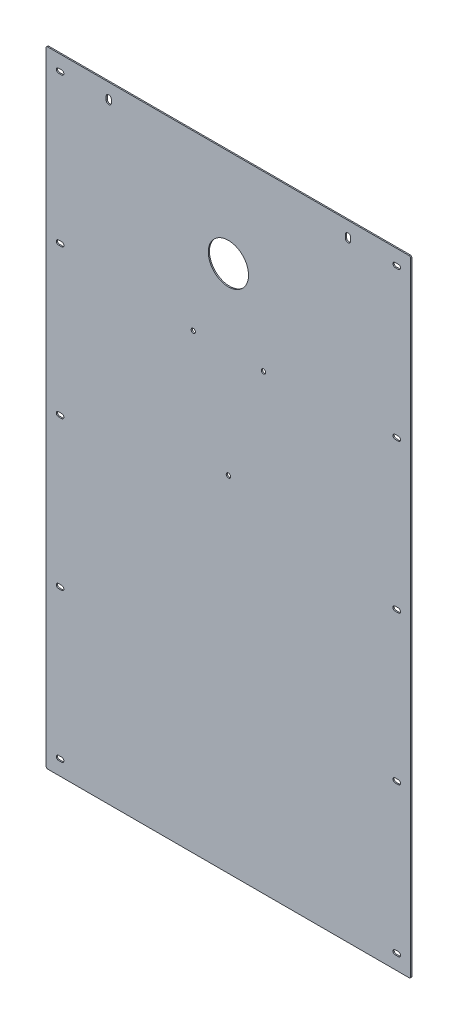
from build123d import *

# Parameters (mm, degrees)
SKIZZE1_W                       = 457
SKIZZE1_H                       = 784
AUFSATZ_LINEAR_AUSTRAGEN1_DEPTH = 1.5
DURCHGANGSLOCH_F_R_M51_D        = 5.5
SCHNITT_LINEAR_AUSTRAGEN3_DEPTH = 454.738360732
VERRUNDUNG2_R                   = 2
SKIZZE7_R                       = 25.25
SCHNITT_LINEAR_AUSTRAGEN4_DEPTH = 454.738360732
DURCHGANGSLOCH_F_R_M61_D        = 6.6
SCHNITT_LINEAR_AUSTRAGEN5_DEPTH = 454.738360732
DURCHGANGSLOCH_F_R_M52_D        = 5.5


with BuildPart() as part:
    # Skizze1 → Aufsatz-Linear austragen1 (new body)
    with BuildSketch(Plane.XY):
        Rectangle(SKIZZE1_W, SKIZZE1_H)
    extrude(amount=AUFSATZ_LINEAR_AUSTRAGEN1_DEPTH)

    # Durchgangsloch f_r M51 (through all)
    with Locations(Plane.XY.offset(1.5)):
        with Locations((-211, 373), (-211, 0), (-211, -373), (211, -373), (211, 0), (211, 373), (211, 186.5), (211, -186.5), (-211, -186.5), (-211, 186.5)):
            Hole(DURCHGANGSLOCH_F_R_M51_D / 2)

    # Skizze6 → Schnitt-Linear austragen3 (cut, through all)
    with BuildSketch(Plane.XY.offset(1.5)):
        with BuildLine():
            Line((213, 370.25), (209, 370.25))
            ThreePointArc((209, 370.25), (206.25, 373), (209, 375.75))
            Line((209, 375.75), (213, 375.75))
            ThreePointArc((213, 375.75), (215.75, 373), (213, 370.25))
        make_face()
        with BuildLine():
            Line((213, 183.75), (209, 183.75))
            ThreePointArc((209, 183.75), (206.25, 186.5), (209, 189.25))
            Line((209, 189.25), (213, 189.25))
            ThreePointArc((213, 189.25), (215.75, 186.5), (213, 183.75))
        make_face()
        with BuildLine():
            Line((213, -2.75), (209, -2.75))
            ThreePointArc((209, -2.75), (206.25, 0), (209, 2.75))
            Line((209, 2.75), (213, 2.75))
            ThreePointArc((213, 2.75), (215.75, 0), (213, -2.75))
        make_face()
        with BuildLine():
            Line((213, -189.25), (209, -189.25))
            ThreePointArc((209, -189.25), (206.25, -186.5), (209, -183.75))
            Line((209, -183.75), (213, -183.75))
            ThreePointArc((213, -183.75), (215.75, -186.5), (213, -189.25))
        make_face()
        with BuildLine():
            Line((213, -375.75), (209, -375.75))
            ThreePointArc((209, -375.75), (206.25, -373), (209, -370.25))
            Line((209, -370.25), (213, -370.25))
            ThreePointArc((213, -370.25), (215.75, -373), (213, -375.75))
        make_face()
        with BuildLine():
            Line((-213, 370.25), (-209, 370.25))
            ThreePointArc((-209, 370.25), (-206.25, 373), (-209, 375.75))
            Line((-209, 375.75), (-213, 375.75))
            ThreePointArc((-213, 375.75), (-215.75, 373), (-213, 370.25))
        make_face()
        with BuildLine():
            Line((-213, 183.75), (-209, 183.75))
            ThreePointArc((-209, 183.75), (-206.25, 186.5), (-209, 189.25))
            Line((-209, 189.25), (-213, 189.25))
            ThreePointArc((-213, 189.25), (-215.75, 186.5), (-213, 183.75))
        make_face()
        with BuildLine():
            Line((-213, -2.75), (-209, -2.75))
            ThreePointArc((-209, -2.75), (-206.25, 0), (-209, 2.75))
            Line((-209, 2.75), (-213, 2.75))
            ThreePointArc((-213, 2.75), (-215.75, 0), (-213, -2.75))
        make_face()
        with BuildLine():
            Line((-213, -189.25), (-209, -189.25))
            ThreePointArc((-209, -189.25), (-206.25, -186.5), (-209, -183.75))
            Line((-209, -183.75), (-213, -183.75))
            ThreePointArc((-213, -183.75), (-215.75, -186.5), (-213, -189.25))
        make_face()
        with BuildLine():
            Line((-213, -375.75), (-209, -375.75))
            ThreePointArc((-209, -375.75), (-206.25, -373), (-209, -370.25))
            Line((-209, -370.25), (-213, -370.25))
            ThreePointArc((-213, -370.25), (-215.75, -373), (-213, -375.75))
        make_face()
    extrude(amount=-SCHNITT_LINEAR_AUSTRAGEN3_DEPTH, mode=Mode.SUBTRACT)

    # Verrundung2
    verrundung2_edges = [part.edges().sort_by_distance(p)[0] for p in [
        (-228.5, -392, 0.75),
        (228.5, -392, 0.75),
        (228.5, 392, 0.75),
        (-228.5, 392, 0.75),
    ]]
    fillet(verrundung2_edges, radius=VERRUNDUNG2_R)

    # Skizze7 → Schnitt-Linear austragen4 (cut, through all)
    with BuildSketch(Plane.XY.offset(1.5)):
        with Locations((0, 270)):
            Circle(SKIZZE7_R)
    extrude(amount=-SCHNITT_LINEAR_AUSTRAGEN4_DEPTH, mode=Mode.SUBTRACT)

    # Durchgangsloch f_r M61 (through all)
    with Locations(Plane.XY.offset(1.5)):
        with Locations((-150, 373), (150, 373)):
            Hole(DURCHGANGSLOCH_F_R_M61_D / 2)

    # Skizze12 → Schnitt-Linear austragen5 (cut, through all)
    with BuildSketch(Plane.XY.offset(1.5)):
        with BuildLine():
            Line((-153.3, 371), (-153.3, 375))
            ThreePointArc((-153.3, 375), (-150, 378.3), (-146.7, 375))
            Line((-146.7, 375), (-146.7, 371))
            ThreePointArc((-146.7, 371), (-150, 367.7), (-153.3, 371))
        make_face()
        with BuildLine():
            Line((146.7, 371), (146.7, 375))
            ThreePointArc((146.7, 375), (150, 378.3), (153.3, 375))
            Line((153.3, 375), (153.3, 371))
            ThreePointArc((153.3, 371), (150, 367.7), (146.7, 371))
        make_face()
    extrude(amount=-SCHNITT_LINEAR_AUSTRAGEN5_DEPTH, mode=Mode.SUBTRACT)

    # Durchgangsloch f_r M52 (through all)
    with Locations(Plane.XY.offset(1.5)):
        with Locations((0, 40), (-44, 175), (44, 175)):
            Hole(DURCHGANGSLOCH_F_R_M52_D / 2)


solid = part.part
